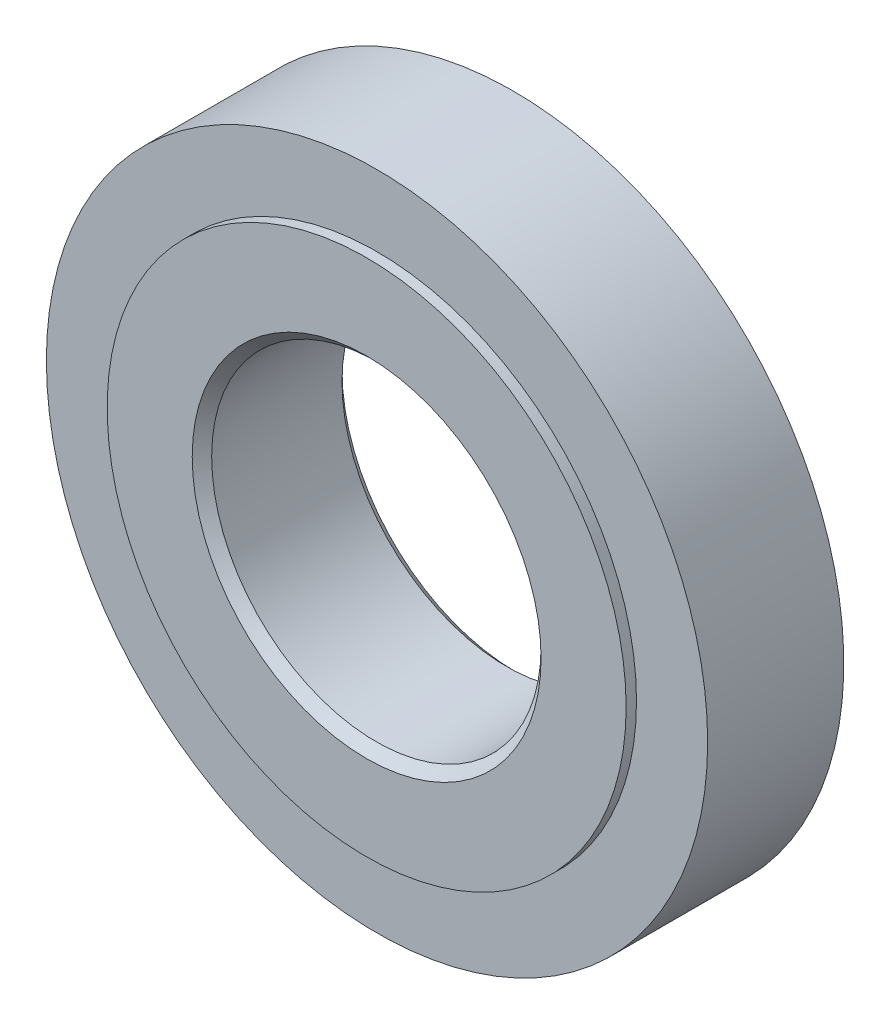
ISO-10303-21;
HEADER;
FILE_DESCRIPTION(('STEP AP214'),'2;1');
FILE_NAME('part.step','',(''),(''),'','','');
FILE_SCHEMA(('AUTOMOTIVE_DESIGN { 1 0 10303 214 1 1 1 1 }'));
ENDSEC;
DATA;
#1=APPLICATION_CONTEXT('core data for automotive mechanical design processes');
#2=APPLICATION_PROTOCOL_DEFINITION('international standard','automotive_design',2000,#1);
#3=PRODUCT_CONTEXT('',#1,'mechanical');
#4=PRODUCT('Part','Part','',(#3));
#5=PRODUCT_RELATED_PRODUCT_CATEGORY('part','',(#4));
#6=PRODUCT_DEFINITION_FORMATION('','',#4);
#7=PRODUCT_DEFINITION_CONTEXT('part definition',#1,'design');
#8=PRODUCT_DEFINITION('design','',#6,#7);
#9=PRODUCT_DEFINITION_SHAPE('','',#8);
#10=(LENGTH_UNIT() NAMED_UNIT(*) SI_UNIT(.MILLI.,.METRE.));
#11=(NAMED_UNIT(*) PLANE_ANGLE_UNIT() SI_UNIT($,.RADIAN.));
#12=(NAMED_UNIT(*) SI_UNIT($,.STERADIAN.) SOLID_ANGLE_UNIT());
#13=UNCERTAINTY_MEASURE_WITH_UNIT(LENGTH_MEASURE(1.E-05),#10,'distance_accuracy_value','');
#14=(GEOMETRIC_REPRESENTATION_CONTEXT(3) GLOBAL_UNCERTAINTY_ASSIGNED_CONTEXT((#13)) GLOBAL_UNIT_ASSIGNED_CONTEXT((#10,
#11,#12)) REPRESENTATION_CONTEXT('',''));
#15=CARTESIAN_POINT('',(0.,0.,0.));
#16=DIRECTION('',(0.,0.,1.));
#17=DIRECTION('',(1.,0.,0.));
#18=AXIS2_PLACEMENT_3D('',#15,#16,#17);
#19=CARTESIAN_POINT('',(0.,0.,11.55));
#20=DIRECTION('',(0.,0.,-1.));
#21=DIRECTION('',(-1.,0.,0.));
#22=AXIS2_PLACEMENT_3D('',#19,#20,#21);
#23=CYLINDRICAL_SURFACE('',#22,51.);
#24=CARTESIAN_POINT('',(0.,0.,9.95));
#25=DIRECTION('',(0.,0.,1.));
#26=DIRECTION('',(1.,0.,0.));
#27=AXIS2_PLACEMENT_3D('',#24,#25,#26);
#28=CIRCLE('',#27,51.);
#29=CARTESIAN_POINT('',(51.,0.,9.95));
#30=VERTEX_POINT('',#29);
#31=EDGE_CURVE('E103',#30,#30,#28,.T.);
#32=ORIENTED_EDGE('',*,*,#31,.F.);
#33=EDGE_LOOP('',(#32));
#34=FACE_BOUND('',#33,.T.);
#35=CARTESIAN_POINT('',(0.,0.,-11.05));
#36=DIRECTION('',(0.,0.,-1.));
#37=DIRECTION('',(-1.,0.,0.));
#38=AXIS2_PLACEMENT_3D('',#35,#36,#37);
#39=CIRCLE('',#38,51.);
#40=CARTESIAN_POINT('',(-51.,0.,-11.05));
#41=VERTEX_POINT('',#40);
#42=EDGE_CURVE('E94',#41,#41,#39,.F.);
#43=ORIENTED_EDGE('',*,*,#42,.T.);
#44=EDGE_LOOP('',(#43));
#45=FACE_BOUND('',#44,.T.);
#46=ADVANCED_FACE('F35',(#34,#45),#23,.T.);
#47=CARTESIAN_POINT('',(0.,0.,9.95));
#48=DIRECTION('',(0.,0.,1.));
#49=DIRECTION('',(1.,0.,0.));
#50=AXIS2_PLACEMENT_3D('',#47,#48,#49);
#51=CYLINDRICAL_SURFACE('',#50,40.025);
#52=CARTESIAN_POINT('',(0.,0.,9.95));
#53=DIRECTION('',(0.,0.,1.));
#54=DIRECTION('',(1.,0.,0.));
#55=AXIS2_PLACEMENT_3D('',#52,#53,#54);
#56=CIRCLE('',#55,40.025);
#57=CARTESIAN_POINT('',(40.025,0.,9.95));
#58=VERTEX_POINT('',#57);
#59=EDGE_CURVE('E100',#58,#58,#56,.T.);
#60=ORIENTED_EDGE('',*,*,#59,.T.);
#61=EDGE_LOOP('',(#60));
#62=FACE_BOUND('',#61,.T.);
#63=CARTESIAN_POINT('',(0.,0.,11.55));
#64=DIRECTION('',(0.,0.,1.));
#65=DIRECTION('',(1.,0.,0.));
#66=AXIS2_PLACEMENT_3D('',#63,#64,#65);
#67=CIRCLE('',#66,40.025);
#68=CARTESIAN_POINT('',(40.025,0.,11.55));
#69=VERTEX_POINT('',#68);
#70=EDGE_CURVE('E97',#69,#69,#67,.T.);
#71=ORIENTED_EDGE('',*,*,#70,.F.);
#72=EDGE_LOOP('',(#71));
#73=FACE_BOUND('',#72,.T.);
#74=ADVANCED_FACE('F153',(#62,#73),#51,.T.);
#75=CARTESIAN_POINT('',(0.,-112.341421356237,9.95));
#76=DIRECTION('',(0.,0.,1.));
#77=DIRECTION('',(1.,0.,0.));
#78=AXIS2_PLACEMENT_3D('',#75,#76,#77);
#79=PLANE('',#78);
#80=ORIENTED_EDGE('',*,*,#59,.F.);
#81=EDGE_LOOP('',(#80));
#82=FACE_BOUND('',#81,.T.);
#83=ORIENTED_EDGE('',*,*,#31,.T.);
#84=EDGE_LOOP('',(#83));
#85=FACE_BOUND('',#84,.T.);
#86=ADVANCED_FACE('F149',(#82,#85),#79,.T.);
#87=CARTESIAN_POINT('',(0.,0.,11.55));
#88=DIRECTION('',(0.,0.,1.));
#89=DIRECTION('',(1.,0.,0.));
#90=AXIS2_PLACEMENT_3D('',#87,#88,#89);
#91=PLANE('',#90);
#92=CARTESIAN_POINT('',(0.,0.,11.55));
#93=DIRECTION('',(0.,0.,1.));
#94=DIRECTION('',(1.,0.,0.));
#95=AXIS2_PLACEMENT_3D('',#92,#93,#94);
#96=CIRCLE('',#95,26.905);
#97=CARTESIAN_POINT('',(26.905,0.,11.55));
#98=VERTEX_POINT('',#97);
#99=EDGE_CURVE('E11',#98,#98,#96,.F.);
#100=ORIENTED_EDGE('',*,*,#99,.T.);
#101=EDGE_LOOP('',(#100));
#102=FACE_BOUND('',#101,.T.);
#103=ORIENTED_EDGE('',*,*,#70,.T.);
#104=EDGE_LOOP('',(#103));
#105=FACE_BOUND('',#104,.T.);
#106=ADVANCED_FACE('F140',(#102,#105),#91,.T.);
#107=CARTESIAN_POINT('',(0.,0.,-11.05));
#108=DIRECTION('',(0.,0.,-1.));
#109=DIRECTION('',(-1.,0.,0.));
#110=AXIS2_PLACEMENT_3D('',#107,#108,#109);
#111=CYLINDRICAL_SURFACE('',#110,40.025);
#112=CARTESIAN_POINT('',(0.,0.,-11.05));
#113=DIRECTION('',(0.,0.,-1.));
#114=DIRECTION('',(-1.,0.,0.));
#115=AXIS2_PLACEMENT_3D('',#112,#113,#114);
#116=CIRCLE('',#115,40.025);
#117=CARTESIAN_POINT('',(-40.025,0.,-11.05));
#118=VERTEX_POINT('',#117);
#119=EDGE_CURVE('E91',#118,#118,#116,.T.);
#120=ORIENTED_EDGE('',*,*,#119,.T.);
#121=EDGE_LOOP('',(#120));
#122=FACE_BOUND('',#121,.T.);
#123=CARTESIAN_POINT('',(0.,0.,-11.55));
#124=DIRECTION('',(0.,0.,-1.));
#125=DIRECTION('',(-1.,0.,0.));
#126=AXIS2_PLACEMENT_3D('',#123,#124,#125);
#127=CIRCLE('',#126,40.025);
#128=CARTESIAN_POINT('',(-40.025,0.,-11.55));
#129=VERTEX_POINT('',#128);
#130=EDGE_CURVE('E88',#129,#129,#127,.T.);
#131=ORIENTED_EDGE('',*,*,#130,.F.);
#132=EDGE_LOOP('',(#131));
#133=FACE_BOUND('',#132,.T.);
#134=ADVANCED_FACE('F138',(#122,#133),#111,.T.);
#135=CARTESIAN_POINT('',(-112.341421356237,0.,-11.05));
#136=DIRECTION('',(0.,0.,-1.));
#137=DIRECTION('',(-1.,0.,0.));
#138=AXIS2_PLACEMENT_3D('',#135,#136,#137);
#139=PLANE('',#138);
#140=ORIENTED_EDGE('',*,*,#119,.F.);
#141=EDGE_LOOP('',(#140));
#142=FACE_BOUND('',#141,.T.);
#143=ORIENTED_EDGE('',*,*,#42,.F.);
#144=EDGE_LOOP('',(#143));
#145=FACE_BOUND('',#144,.T.);
#146=ADVANCED_FACE('F126',(#142,#145),#139,.T.);
#147=CARTESIAN_POINT('',(0.,0.,-11.55));
#148=DIRECTION('',(0.,0.,1.));
#149=DIRECTION('',(1.,0.,0.));
#150=AXIS2_PLACEMENT_3D('',#147,#148,#149);
#151=PLANE('',#150);
#152=CARTESIAN_POINT('',(0.,0.,-11.55));
#153=DIRECTION('',(0.,0.,1.));
#154=DIRECTION('',(1.,0.,0.));
#155=AXIS2_PLACEMENT_3D('',#152,#153,#154);
#156=CIRCLE('',#155,26.905);
#157=CARTESIAN_POINT('',(26.905,0.,-11.55));
#158=VERTEX_POINT('',#157);
#159=EDGE_CURVE('E106',#158,#158,#156,.T.);
#160=ORIENTED_EDGE('',*,*,#159,.T.);
#161=EDGE_LOOP('',(#160));
#162=FACE_BOUND('',#161,.T.);
#163=CARTESIAN_POINT('',(0.,32.,-11.55));
#164=DIRECTION('',(0.,0.,-1.));
#165=DIRECTION('',(-1.,0.,0.));
#166=AXIS2_PLACEMENT_3D('',#163,#164,#165);
#167=CIRCLE('',#166,2.1);
#168=CARTESIAN_POINT('',(-2.1,32.,-11.55));
#169=VERTEX_POINT('',#168);
#170=EDGE_CURVE('E65',#169,#169,#167,.T.);
#171=ORIENTED_EDGE('',*,*,#170,.F.);
#172=EDGE_LOOP('',(#171));
#173=FACE_BOUND('',#172,.T.);
#174=CARTESIAN_POINT('',(-32.,0.,-11.55));
#175=DIRECTION('',(0.,0.,-1.));
#176=DIRECTION('',(-1.,0.,0.));
#177=AXIS2_PLACEMENT_3D('',#174,#175,#176);
#178=CIRCLE('',#177,2.1);
#179=CARTESIAN_POINT('',(-34.1,0.,-11.55));
#180=VERTEX_POINT('',#179);
#181=EDGE_CURVE('E73',#180,#180,#178,.T.);
#182=ORIENTED_EDGE('',*,*,#181,.F.);
#183=EDGE_LOOP('',(#182));
#184=FACE_BOUND('',#183,.T.);
#185=CARTESIAN_POINT('',(32.,0.,-11.55));
#186=DIRECTION('',(0.,0.,-1.));
#187=DIRECTION('',(-1.,0.,0.));
#188=AXIS2_PLACEMENT_3D('',#185,#186,#187);
#189=CIRCLE('',#188,2.1);
#190=CARTESIAN_POINT('',(29.9,0.,-11.55));
#191=VERTEX_POINT('',#190);
#192=EDGE_CURVE('E79',#191,#191,#189,.T.);
#193=ORIENTED_EDGE('',*,*,#192,.F.);
#194=EDGE_LOOP('',(#193));
#195=FACE_BOUND('',#194,.T.);
#196=CARTESIAN_POINT('',(0.,-32.,-11.55));
#197=DIRECTION('',(0.,0.,-1.));
#198=DIRECTION('',(-1.,0.,0.));
#199=AXIS2_PLACEMENT_3D('',#196,#197,#198);
#200=CIRCLE('',#199,2.1);
#201=CARTESIAN_POINT('',(-2.1,-32.,-11.55));
#202=VERTEX_POINT('',#201);
#203=EDGE_CURVE('E85',#202,#202,#200,.T.);
#204=ORIENTED_EDGE('',*,*,#203,.F.);
#205=EDGE_LOOP('',(#204));
#206=FACE_BOUND('',#205,.T.);
#207=ORIENTED_EDGE('',*,*,#130,.T.);
#208=EDGE_LOOP('',(#207));
#209=FACE_BOUND('',#208,.T.);
#210=ADVANCED_FACE('F123',(#162,#173,#184,#195,#206,#209),#151,.F.);
#211=CARTESIAN_POINT('',(0.,0.,-11.55));
#212=DIRECTION('',(0.,0.,1.));
#213=DIRECTION('',(1.,0.,0.));
#214=AXIS2_PLACEMENT_3D('',#211,#212,#213);
#215=CYLINDRICAL_SURFACE('',#214,25.405);
#216=CARTESIAN_POINT('',(0.,0.,-10.05));
#217=DIRECTION('',(0.,0.,1.));
#218=DIRECTION('',(1.,0.,0.));
#219=AXIS2_PLACEMENT_3D('',#216,#217,#218);
#220=CIRCLE('',#219,25.405);
#221=CARTESIAN_POINT('',(25.405,0.,-10.05));
#222=VERTEX_POINT('',#221);
#223=EDGE_CURVE('E42',#222,#222,#220,.F.);
#224=ORIENTED_EDGE('',*,*,#223,.T.);
#225=EDGE_LOOP('',(#224));
#226=FACE_BOUND('',#225,.T.);
#227=CARTESIAN_POINT('',(0.,0.,10.05));
#228=DIRECTION('',(0.,0.,1.));
#229=DIRECTION('',(1.,0.,0.));
#230=AXIS2_PLACEMENT_3D('',#227,#228,#229);
#231=CIRCLE('',#230,25.405);
#232=CARTESIAN_POINT('',(25.405,0.,10.05));
#233=VERTEX_POINT('',#232);
#234=EDGE_CURVE('E109',#233,#233,#231,.T.);
#235=ORIENTED_EDGE('',*,*,#234,.T.);
#236=EDGE_LOOP('',(#235));
#237=FACE_BOUND('',#236,.T.);
#238=ADVANCED_FACE('F114',(#226,#237),#215,.F.);
#239=CARTESIAN_POINT('',(0.,-32.,-11.55));
#240=DIRECTION('',(0.,0.,-1.));
#241=DIRECTION('',(-1.,0.,0.));
#242=AXIS2_PLACEMENT_3D('',#239,#240,#241);
#243=CYLINDRICAL_SURFACE('',#242,2.1);
#244=CARTESIAN_POINT('',(0.,-32.,1.15));
#245=DIRECTION('',(0.,0.,-1.));
#246=DIRECTION('',(-1.,0.,0.));
#247=AXIS2_PLACEMENT_3D('',#244,#245,#246);
#248=CIRCLE('',#247,2.1);
#249=CARTESIAN_POINT('',(-2.1,-32.,1.15));
#250=VERTEX_POINT('',#249);
#251=EDGE_CURVE('E82',#250,#250,#248,.T.);
#252=ORIENTED_EDGE('',*,*,#251,.F.);
#253=EDGE_LOOP('',(#252));
#254=FACE_BOUND('',#253,.T.);
#255=ORIENTED_EDGE('',*,*,#203,.T.);
#256=EDGE_LOOP('',(#255));
#257=FACE_BOUND('',#256,.T.);
#258=ADVANCED_FACE('F200',(#254,#257),#243,.F.);
#259=CARTESIAN_POINT('',(0.,-32.,1.15));
#260=DIRECTION('',(0.,0.,-1.));
#261=DIRECTION('',(-1.,0.,0.));
#262=AXIS2_PLACEMENT_3D('',#259,#260,#261);
#263=CONICAL_SURFACE('',#262,2.1,1.02974425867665);
#264=CARTESIAN_POINT('',(0.,-32.,2.41180729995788));
#265=VERTEX_POINT('',#264);
#266=VERTEX_LOOP('',#265);
#267=FACE_BOUND('',#266,.T.);
#268=ORIENTED_EDGE('',*,*,#251,.T.);
#269=EDGE_LOOP('',(#268));
#270=FACE_BOUND('',#269,.T.);
#271=ADVANCED_FACE('F241',(#267,#270),#263,.F.);
#272=CARTESIAN_POINT('',(32.,0.,-11.55));
#273=DIRECTION('',(0.,0.,-1.));
#274=DIRECTION('',(-1.,0.,0.));
#275=AXIS2_PLACEMENT_3D('',#272,#273,#274);
#276=CYLINDRICAL_SURFACE('',#275,2.1);
#277=CARTESIAN_POINT('',(32.,0.,1.15));
#278=DIRECTION('',(0.,0.,-1.));
#279=DIRECTION('',(-1.,0.,0.));
#280=AXIS2_PLACEMENT_3D('',#277,#278,#279);
#281=CIRCLE('',#280,2.1);
#282=CARTESIAN_POINT('',(29.9,0.,1.15));
#283=VERTEX_POINT('',#282);
#284=EDGE_CURVE('E76',#283,#283,#281,.T.);
#285=ORIENTED_EDGE('',*,*,#284,.F.);
#286=EDGE_LOOP('',(#285));
#287=FACE_BOUND('',#286,.T.);
#288=ORIENTED_EDGE('',*,*,#192,.T.);
#289=EDGE_LOOP('',(#288));
#290=FACE_BOUND('',#289,.T.);
#291=ADVANCED_FACE('F238',(#287,#290),#276,.F.);
#292=CARTESIAN_POINT('',(32.,0.,1.15));
#293=DIRECTION('',(0.,0.,-1.));
#294=DIRECTION('',(-1.,0.,0.));
#295=AXIS2_PLACEMENT_3D('',#292,#293,#294);
#296=CONICAL_SURFACE('',#295,2.1,1.02974425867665);
#297=CARTESIAN_POINT('',(32.,0.,2.41180729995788));
#298=VERTEX_POINT('',#297);
#299=VERTEX_LOOP('',#298);
#300=FACE_BOUND('',#299,.T.);
#301=ORIENTED_EDGE('',*,*,#284,.T.);
#302=EDGE_LOOP('',(#301));
#303=FACE_BOUND('',#302,.T.);
#304=ADVANCED_FACE('F234',(#300,#303),#296,.F.);
#305=CARTESIAN_POINT('',(-32.,0.,-11.55));
#306=DIRECTION('',(0.,0.,-1.));
#307=DIRECTION('',(-1.,0.,0.));
#308=AXIS2_PLACEMENT_3D('',#305,#306,#307);
#309=CYLINDRICAL_SURFACE('',#308,2.1);
#310=CARTESIAN_POINT('',(-32.,0.,1.15));
#311=DIRECTION('',(0.,0.,-1.));
#312=DIRECTION('',(-1.,0.,0.));
#313=AXIS2_PLACEMENT_3D('',#310,#311,#312);
#314=CIRCLE('',#313,2.1);
#315=CARTESIAN_POINT('',(-34.1,0.,1.15));
#316=VERTEX_POINT('',#315);
#317=EDGE_CURVE('E68',#316,#316,#314,.T.);
#318=ORIENTED_EDGE('',*,*,#317,.F.);
#319=EDGE_LOOP('',(#318));
#320=FACE_BOUND('',#319,.T.);
#321=ORIENTED_EDGE('',*,*,#181,.T.);
#322=EDGE_LOOP('',(#321));
#323=FACE_BOUND('',#322,.T.);
#324=ADVANCED_FACE('F230',(#320,#323),#309,.F.);
#325=CARTESIAN_POINT('',(-32.,0.,1.15));
#326=DIRECTION('',(0.,0.,-1.));
#327=DIRECTION('',(-1.,0.,0.));
#328=AXIS2_PLACEMENT_3D('',#325,#326,#327);
#329=CONICAL_SURFACE('',#328,2.1,1.02974425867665);
#330=CARTESIAN_POINT('',(-32.,0.,2.41180729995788));
#331=VERTEX_POINT('',#330);
#332=VERTEX_LOOP('',#331);
#333=FACE_BOUND('',#332,.T.);
#334=ORIENTED_EDGE('',*,*,#317,.T.);
#335=EDGE_LOOP('',(#334));
#336=FACE_BOUND('',#335,.T.);
#337=ADVANCED_FACE('F227',(#333,#336),#329,.F.);
#338=CARTESIAN_POINT('',(0.,32.,-11.55));
#339=DIRECTION('',(0.,0.,-1.));
#340=DIRECTION('',(-1.,0.,0.));
#341=AXIS2_PLACEMENT_3D('',#338,#339,#340);
#342=CYLINDRICAL_SURFACE('',#341,2.1);
#343=CARTESIAN_POINT('',(0.,32.,1.15));
#344=DIRECTION('',(0.,0.,-1.));
#345=DIRECTION('',(-1.,0.,0.));
#346=AXIS2_PLACEMENT_3D('',#343,#344,#345);
#347=CIRCLE('',#346,2.1);
#348=CARTESIAN_POINT('',(-2.1,32.,1.15));
#349=VERTEX_POINT('',#348);
#350=EDGE_CURVE('E63',#349,#349,#347,.T.);
#351=ORIENTED_EDGE('',*,*,#350,.F.);
#352=EDGE_LOOP('',(#351));
#353=FACE_BOUND('',#352,.T.);
#354=ORIENTED_EDGE('',*,*,#170,.T.);
#355=EDGE_LOOP('',(#354));
#356=FACE_BOUND('',#355,.T.);
#357=ADVANCED_FACE('F59',(#353,#356),#342,.F.);
#358=CARTESIAN_POINT('',(0.,32.,1.15));
#359=DIRECTION('',(0.,0.,-1.));
#360=DIRECTION('',(-1.,0.,0.));
#361=AXIS2_PLACEMENT_3D('',#358,#359,#360);
#362=CONICAL_SURFACE('',#361,2.1,1.02974425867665);
#363=CARTESIAN_POINT('',(0.,32.,2.41180729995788));
#364=VERTEX_POINT('',#363);
#365=VERTEX_LOOP('',#364);
#366=FACE_BOUND('',#365,.T.);
#367=ORIENTED_EDGE('',*,*,#350,.T.);
#368=EDGE_LOOP('',(#367));
#369=FACE_BOUND('',#368,.T.);
#370=ADVANCED_FACE('F55',(#366,#369),#362,.F.);
#371=CARTESIAN_POINT('',(0.,0.,-11.55));
#372=DIRECTION('',(0.,0.,-1.));
#373=DIRECTION('',(-1.,0.,0.));
#374=AXIS2_PLACEMENT_3D('',#371,#372,#373);
#375=CONICAL_SURFACE('',#374,26.905,0.785398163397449);
#376=ORIENTED_EDGE('',*,*,#223,.F.);
#377=EDGE_LOOP('',(#376));
#378=FACE_BOUND('',#377,.T.);
#379=ORIENTED_EDGE('',*,*,#159,.F.);
#380=EDGE_LOOP('',(#379));
#381=FACE_BOUND('',#380,.T.);
#382=ADVANCED_FACE('F58',(#378,#381),#375,.F.);
#383=CARTESIAN_POINT('',(0.,0.,10.05));
#384=DIRECTION('',(0.,0.,1.));
#385=DIRECTION('',(1.,0.,0.));
#386=AXIS2_PLACEMENT_3D('',#383,#384,#385);
#387=CONICAL_SURFACE('',#386,25.405,0.785398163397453);
#388=CARTESIAN_POINT('',(26.905,0.,11.55));
#389=CARTESIAN_POINT('',(26.889375,0.,11.534375));
#390=CARTESIAN_POINT('',(26.87375,0.,11.51875));
#391=CARTESIAN_POINT('',(26.8425,0.,11.4875));
#392=CARTESIAN_POINT('',(26.826875,0.,11.471875));
#393=CARTESIAN_POINT('',(26.795625,0.,11.440625));
#394=CARTESIAN_POINT('',(26.78,0.,11.425));
#395=CARTESIAN_POINT('',(26.74875,0.,11.39375));
#396=CARTESIAN_POINT('',(26.733125,0.,11.378125));
#397=CARTESIAN_POINT('',(26.701875,0.,11.346875));
#398=CARTESIAN_POINT('',(26.68625,0.,11.33125));
#399=CARTESIAN_POINT('',(26.655,0.,11.3));
#400=CARTESIAN_POINT('',(26.639375,0.,11.284375));
#401=CARTESIAN_POINT('',(26.608125,0.,11.253125));
#402=CARTESIAN_POINT('',(26.5925,0.,11.2375));
#403=CARTESIAN_POINT('',(26.56125,0.,11.20625));
#404=CARTESIAN_POINT('',(26.545625,0.,11.190625));
#405=CARTESIAN_POINT('',(26.514375,0.,11.159375));
#406=CARTESIAN_POINT('',(26.49875,0.,11.14375));
#407=CARTESIAN_POINT('',(26.4675,0.,11.1125));
#408=CARTESIAN_POINT('',(26.451875,0.,11.096875));
#409=CARTESIAN_POINT('',(26.420625,0.,11.065625));
#410=CARTESIAN_POINT('',(26.405,0.,11.05));
#411=CARTESIAN_POINT('',(26.37375,0.,11.01875));
#412=CARTESIAN_POINT('',(26.358125,0.,11.003125));
#413=CARTESIAN_POINT('',(26.326875,0.,10.971875));
#414=CARTESIAN_POINT('',(26.31125,0.,10.95625));
#415=CARTESIAN_POINT('',(26.28,0.,10.925));
#416=CARTESIAN_POINT('',(26.264375,0.,10.909375));
#417=CARTESIAN_POINT('',(26.233125,0.,10.878125));
#418=CARTESIAN_POINT('',(26.2175,0.,10.8625));
#419=CARTESIAN_POINT('',(26.18625,0.,10.83125));
#420=CARTESIAN_POINT('',(26.170625,0.,10.815625));
#421=CARTESIAN_POINT('',(26.139375,0.,10.784375));
#422=CARTESIAN_POINT('',(26.12375,0.,10.76875));
#423=CARTESIAN_POINT('',(26.0925,0.,10.7375));
#424=CARTESIAN_POINT('',(26.076875,0.,10.721875));
#425=CARTESIAN_POINT('',(26.045625,0.,10.690625));
#426=CARTESIAN_POINT('',(26.03,0.,10.675));
#427=CARTESIAN_POINT('',(25.99875,0.,10.64375));
#428=CARTESIAN_POINT('',(25.983125,0.,10.628125));
#429=CARTESIAN_POINT('',(25.951875,0.,10.596875));
#430=CARTESIAN_POINT('',(25.93625,0.,10.58125));
#431=CARTESIAN_POINT('',(25.905,0.,10.55));
#432=CARTESIAN_POINT('',(25.889375,0.,10.534375));
#433=CARTESIAN_POINT('',(25.858125,0.,10.503125));
#434=CARTESIAN_POINT('',(25.8425,0.,10.4875));
#435=CARTESIAN_POINT('',(25.81125,0.,10.45625));
#436=CARTESIAN_POINT('',(25.795625,0.,10.440625));
#437=CARTESIAN_POINT('',(25.764375,0.,10.409375));
#438=CARTESIAN_POINT('',(25.74875,0.,10.39375));
#439=CARTESIAN_POINT('',(25.7175,0.,10.3625));
#440=CARTESIAN_POINT('',(25.701875,0.,10.346875));
#441=CARTESIAN_POINT('',(25.670625,0.,10.315625));
#442=CARTESIAN_POINT('',(25.655,0.,10.3));
#443=CARTESIAN_POINT('',(25.62375,0.,10.26875));
#444=CARTESIAN_POINT('',(25.608125,0.,10.253125));
#445=CARTESIAN_POINT('',(25.576875,0.,10.221875));
#446=CARTESIAN_POINT('',(25.56125,0.,10.20625));
#447=CARTESIAN_POINT('',(25.53,0.,10.175));
#448=CARTESIAN_POINT('',(25.514375,0.,10.159375));
#449=CARTESIAN_POINT('',(25.483125,0.,10.128125));
#450=CARTESIAN_POINT('',(25.4675,0.,10.1125));
#451=CARTESIAN_POINT('',(25.43625,0.,10.08125));
#452=CARTESIAN_POINT('',(25.420625,0.,10.065625));
#453=CARTESIAN_POINT('',(25.405,0.,10.05));
#454=B_SPLINE_CURVE_WITH_KNOTS('',3,(#388,#389,#390,#391,#392,#393,#394,#395,#396,#397,#398,
#399,#400,#401,#402,#403,#404,#405,#406,#407,#408,#409,#410,#411,#412,#413,#414,#415,#416,#417,
#418,#419,#420,#421,#422,#423,#424,#425,#426,#427,#428,#429,#430,#431,#432,#433,#434,#435,#436,
#437,#438,#439,#440,#441,#442,#443,#444,#445,#446,#447,#448,#449,#450,#451,#452,#453),
.UNSPECIFIED.,.F.,.F.,(4,2,2,2,2,2,2,2,2,2,2,2,2,2,2,2,2,2,2,2,2,2,2,2,2,2,2,2,2,2,2,2,4),(0.,
0.0662912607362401,0.13258252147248,0.198873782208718,0.265165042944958,0.331456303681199,
0.397747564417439,0.464038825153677,0.530330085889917,0.596621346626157,0.662912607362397,
0.729203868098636,0.795495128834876,0.861786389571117,0.928077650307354,0.994368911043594,
1.06066017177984,1.12695143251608,1.19324269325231,1.25953395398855,1.32582521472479,
1.39211647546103,1.45840773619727,1.52469899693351,1.59099025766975,1.65728151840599,
1.72357277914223,1.78986403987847,1.85615530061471,1.92244656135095,1.98873782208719,
2.05502908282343,2.12132034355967),.UNSPECIFIED.);
#455=EDGE_CURVE('BSEAM119',#98,#233,#454,.T.);
#456=ORIENTED_EDGE('',*,*,#99,.F.);
#457=ORIENTED_EDGE('',*,*,#234,.F.);
#458=ORIENTED_EDGE('',*,*,#455,.T.);
#459=ORIENTED_EDGE('',*,*,#455,.F.);
#460=EDGE_LOOP('',(#456,#458,#457,#459));
#461=FACE_BOUND('',#460,.T.);
#462=ADVANCED_FACE('F119',(#461),#387,.F.);
#463=CLOSED_SHELL('',(#46,#74,#86,#106,#134,#146,#210,#238,#258,#271,#291,#304,#324,#337,#357,
#370,#382,#462));
#464=MANIFOLD_SOLID_BREP('B2',#463);
#465=ADVANCED_BREP_SHAPE_REPRESENTATION('',(#18,#464),#14);
#466=SHAPE_DEFINITION_REPRESENTATION(#9,#465);
ENDSEC;
END-ISO-10303-21;
